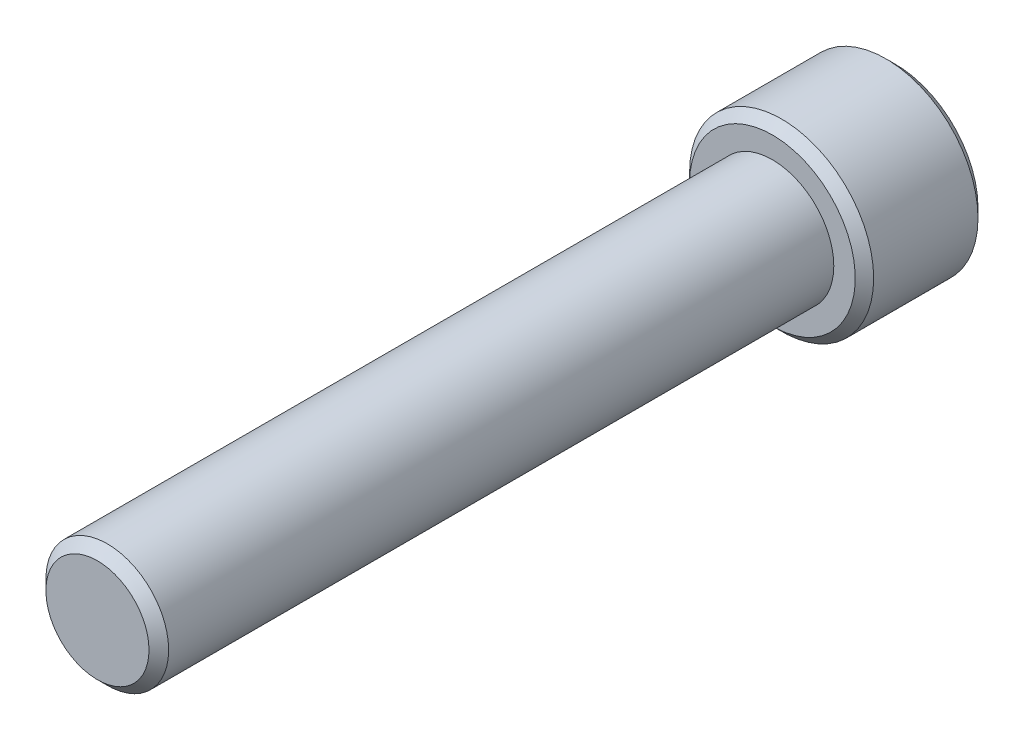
from build123d import *

# Parameters (mm, degrees)
SKETCH1_R          = 3.175
EXTRUDE1_DEPTH     = 34.925
SKETCH6_R          = 4.7625
EXTRUDE2_DEPTH     = 6.35
CUT_EXTRUDE1_DEPTH = 3.571875
CHAMFER1_SIZE      = 0.47625
CHAMFER2_SIZE      = 0.508


with BuildPart() as part:
    # Sketch1 → Extrude1 (new body)
    with BuildSketch(Plane.XY):
        Circle(SKETCH1_R)
    extrude(amount=-EXTRUDE1_DEPTH)

    # Sketch6 → Extrude2 (add)
    with BuildSketch(Plane(origin=(0, 0, -34.925), x_dir=(-1, 0, 0), z_dir=(0, 0, -1))):
        Circle(SKETCH6_R)
    extrude(amount=EXTRUDE2_DEPTH)

    # Sketch7 → Cut-Extrude1 (cut)
    with BuildSketch(Plane(origin=(0, 0, -41.275), x_dir=(-1, 0, 0), z_dir=(0, 0, -1))):
        Polygon((0, 2.749630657), (-2.38125, 1.374815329), (-2.38125, -1.374815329), (0, -2.749630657), (2.38125, -1.374815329), (2.38125, 1.374815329), align=None)
    extrude(amount=-CUT_EXTRUDE1_DEPTH, mode=Mode.SUBTRACT)

    # Cut-Extrude2 cone 1 section (on through the dimple's axis) → Cut-Extrude2 (revolve, cut)
    with BuildSketch(Plane(origin=(0, 0, -41.275), x_dir=(0, 1, 0), z_dir=(1, 0, 0))):
        Polygon((0, 0), (2.749630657, 0), (0, 2.749630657), align=None)
    revolve(axis=Axis((0, 0, -41.275), (0, 0, 1)), mode=Mode.SUBTRACT)

    # Chamfer1
    chamfer1_edges = [part.edges().sort_by_distance(p)[0] for p in [
        (4.7625, 0, -34.925),
        (4.7625, 0, -41.275),
    ]]
    chamfer(chamfer1_edges, length=CHAMFER1_SIZE)

    # Chamfer2
    chamfer2_edges = [part.edges().sort_by_distance(p)[0] for p in [
        (-3.175, 0, 0),
    ]]
    chamfer(chamfer2_edges, length=CHAMFER2_SIZE)


solid = part.part
